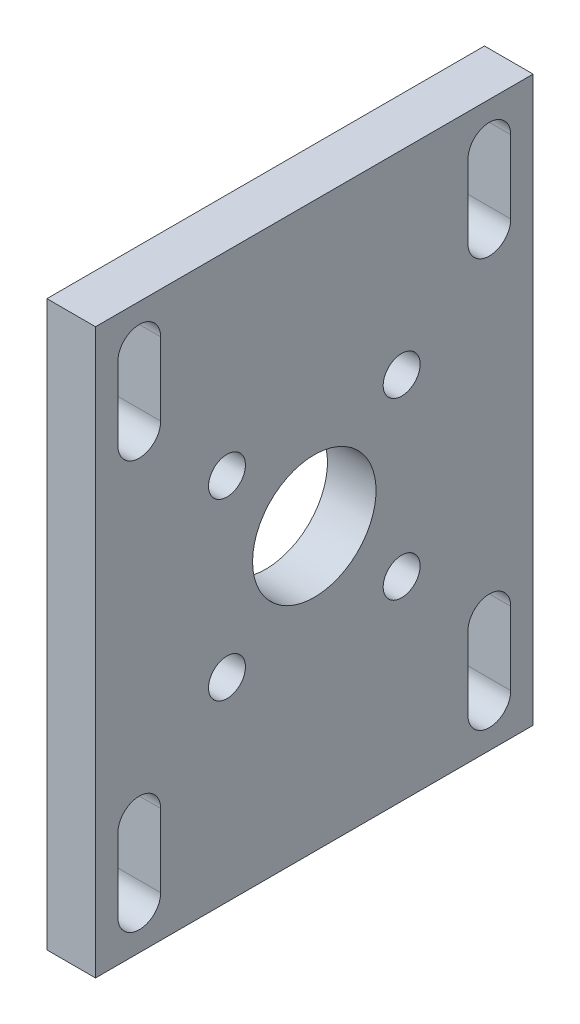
ISO-10303-21;
HEADER;
FILE_DESCRIPTION(('STEP AP214'),'2;1');
FILE_NAME('part.step','',(''),(''),'','','');
FILE_SCHEMA(('AUTOMOTIVE_DESIGN { 1 0 10303 214 1 1 1 1 }'));
ENDSEC;
DATA;
#1=APPLICATION_CONTEXT('core data for automotive mechanical design processes');
#2=APPLICATION_PROTOCOL_DEFINITION('international standard','automotive_design',2000,#1);
#3=PRODUCT_CONTEXT('',#1,'mechanical');
#4=PRODUCT('Part','Part','',(#3));
#5=PRODUCT_RELATED_PRODUCT_CATEGORY('part','',(#4));
#6=PRODUCT_DEFINITION_FORMATION('','',#4);
#7=PRODUCT_DEFINITION_CONTEXT('part definition',#1,'design');
#8=PRODUCT_DEFINITION('design','',#6,#7);
#9=PRODUCT_DEFINITION_SHAPE('','',#8);
#10=(LENGTH_UNIT() NAMED_UNIT(*) SI_UNIT(.MILLI.,.METRE.));
#11=(NAMED_UNIT(*) PLANE_ANGLE_UNIT() SI_UNIT($,.RADIAN.));
#12=(NAMED_UNIT(*) SI_UNIT($,.STERADIAN.) SOLID_ANGLE_UNIT());
#13=UNCERTAINTY_MEASURE_WITH_UNIT(LENGTH_MEASURE(1.E-05),#10,'distance_accuracy_value','');
#14=(GEOMETRIC_REPRESENTATION_CONTEXT(3) GLOBAL_UNCERTAINTY_ASSIGNED_CONTEXT((#13)) GLOBAL_UNIT_ASSIGNED_CONTEXT((#10,
#11,#12)) REPRESENTATION_CONTEXT('',''));
#15=CARTESIAN_POINT('',(0.,0.,0.));
#16=DIRECTION('',(0.,0.,1.));
#17=DIRECTION('',(1.,0.,0.));
#18=AXIS2_PLACEMENT_3D('',#15,#16,#17);
#19=CARTESIAN_POINT('',(5.,-29.,-22.5));
#20=DIRECTION('',(0.,0.,1.));
#21=DIRECTION('',(1.,0.,0.));
#22=AXIS2_PLACEMENT_3D('',#19,#20,#21);
#23=PLANE('',#22);
#24=DIRECTION('',(0.,1.,0.));
#25=VECTOR('',#24,1.);
#26=CARTESIAN_POINT('',(0.,-29.,-22.5));
#27=LINE('',#26,#25);
#28=CARTESIAN_POINT('',(0.,-29.,-22.5));
#29=VERTEX_POINT('',#28);
#30=CARTESIAN_POINT('',(0.,29.,-22.5));
#31=VERTEX_POINT('',#30);
#32=EDGE_CURVE('E285',#29,#31,#27,.T.);
#33=ORIENTED_EDGE('',*,*,#32,.T.);
#34=DIRECTION('',(-1.,0.,0.));
#35=VECTOR('',#34,1.);
#36=CARTESIAN_POINT('',(5.,29.,-22.5));
#37=LINE('',#36,#35);
#38=CARTESIAN_POINT('',(5.,29.,-22.5));
#39=VERTEX_POINT('',#38);
#40=EDGE_CURVE('E314',#39,#31,#37,.T.);
#41=ORIENTED_EDGE('',*,*,#40,.F.);
#42=DIRECTION('',(0.,1.,0.));
#43=VECTOR('',#42,1.);
#44=CARTESIAN_POINT('',(5.,-29.,-22.5));
#45=LINE('',#44,#43);
#46=CARTESIAN_POINT('',(5.,-29.,-22.5));
#47=VERTEX_POINT('',#46);
#48=EDGE_CURVE('E288',#47,#39,#45,.T.);
#49=ORIENTED_EDGE('',*,*,#48,.F.);
#50=DIRECTION('',(-1.,0.,0.));
#51=VECTOR('',#50,1.);
#52=CARTESIAN_POINT('',(5.,-29.,-22.5));
#53=LINE('',#52,#51);
#54=EDGE_CURVE('E298',#47,#29,#53,.T.);
#55=ORIENTED_EDGE('',*,*,#54,.T.);
#56=EDGE_LOOP('',(#33,#41,#49,#55));
#57=FACE_BOUND('',#56,.T.);
#58=ADVANCED_FACE('F33',(#57),#23,.F.);
#59=CARTESIAN_POINT('',(5.,29.,22.5));
#60=DIRECTION('',(0.,-1.,0.));
#61=DIRECTION('',(0.,0.,-1.));
#62=AXIS2_PLACEMENT_3D('',#59,#60,#61);
#63=PLANE('',#62);
#64=DIRECTION('',(0.,0.,1.));
#65=VECTOR('',#64,1.);
#66=CARTESIAN_POINT('',(0.,29.,22.5));
#67=LINE('',#66,#65);
#68=CARTESIAN_POINT('',(0.,29.,22.5));
#69=VERTEX_POINT('',#68);
#70=EDGE_CURVE('E301',#31,#69,#67,.T.);
#71=ORIENTED_EDGE('',*,*,#70,.T.);
#72=DIRECTION('',(-1.,0.,0.));
#73=VECTOR('',#72,1.);
#74=CARTESIAN_POINT('',(5.,29.,22.5));
#75=LINE('',#74,#73);
#76=CARTESIAN_POINT('',(5.,29.,22.5));
#77=VERTEX_POINT('',#76);
#78=EDGE_CURVE('E311',#77,#69,#75,.T.);
#79=ORIENTED_EDGE('',*,*,#78,.F.);
#80=DIRECTION('',(0.,0.,1.));
#81=VECTOR('',#80,1.);
#82=CARTESIAN_POINT('',(5.,29.,22.5));
#83=LINE('',#82,#81);
#84=EDGE_CURVE('E291',#39,#77,#83,.T.);
#85=ORIENTED_EDGE('',*,*,#84,.F.);
#86=ORIENTED_EDGE('',*,*,#40,.T.);
#87=EDGE_LOOP('',(#71,#79,#85,#86));
#88=FACE_BOUND('',#87,.T.);
#89=ADVANCED_FACE('F391',(#88),#63,.F.);
#90=CARTESIAN_POINT('',(5.,-29.,22.5));
#91=DIRECTION('',(0.,0.,-1.));
#92=DIRECTION('',(-1.,0.,0.));
#93=AXIS2_PLACEMENT_3D('',#90,#91,#92);
#94=PLANE('',#93);
#95=DIRECTION('',(0.,-1.,0.));
#96=VECTOR('',#95,1.);
#97=CARTESIAN_POINT('',(0.,-29.,22.5));
#98=LINE('',#97,#96);
#99=CARTESIAN_POINT('',(0.,-29.,22.5));
#100=VERTEX_POINT('',#99);
#101=EDGE_CURVE('E303',#69,#100,#98,.T.);
#102=ORIENTED_EDGE('',*,*,#101,.T.);
#103=DIRECTION('',(-1.,0.,0.));
#104=VECTOR('',#103,1.);
#105=CARTESIAN_POINT('',(5.,-29.,22.5));
#106=LINE('',#105,#104);
#107=CARTESIAN_POINT('',(5.,-29.,22.5));
#108=VERTEX_POINT('',#107);
#109=EDGE_CURVE('E308',#108,#100,#106,.T.);
#110=ORIENTED_EDGE('',*,*,#109,.F.);
#111=DIRECTION('',(0.,-1.,0.));
#112=VECTOR('',#111,1.);
#113=CARTESIAN_POINT('',(5.,-29.,22.5));
#114=LINE('',#113,#112);
#115=EDGE_CURVE('E294',#77,#108,#114,.T.);
#116=ORIENTED_EDGE('',*,*,#115,.F.);
#117=ORIENTED_EDGE('',*,*,#78,.T.);
#118=EDGE_LOOP('',(#102,#110,#116,#117));
#119=FACE_BOUND('',#118,.T.);
#120=ADVANCED_FACE('F397',(#119),#94,.F.);
#121=CARTESIAN_POINT('',(5.,-29.,22.5));
#122=DIRECTION('',(0.,1.,0.));
#123=DIRECTION('',(0.,0.,1.));
#124=AXIS2_PLACEMENT_3D('',#121,#122,#123);
#125=PLANE('',#124);
#126=DIRECTION('',(0.,0.,-1.));
#127=VECTOR('',#126,1.);
#128=CARTESIAN_POINT('',(0.,-29.,22.5));
#129=LINE('',#128,#127);
#130=EDGE_CURVE('E292',#100,#29,#129,.T.);
#131=ORIENTED_EDGE('',*,*,#130,.T.);
#132=ORIENTED_EDGE('',*,*,#54,.F.);
#133=DIRECTION('',(0.,0.,-1.));
#134=VECTOR('',#133,1.);
#135=CARTESIAN_POINT('',(5.,-29.,22.5));
#136=LINE('',#135,#134);
#137=EDGE_CURVE('E296',#108,#47,#136,.T.);
#138=ORIENTED_EDGE('',*,*,#137,.F.);
#139=ORIENTED_EDGE('',*,*,#109,.T.);
#140=EDGE_LOOP('',(#131,#132,#138,#139));
#141=FACE_BOUND('',#140,.T.);
#142=ADVANCED_FACE('F441',(#141),#125,.F.);
#143=CARTESIAN_POINT('',(5.,0.,0.));
#144=DIRECTION('',(-1.,0.,0.));
#145=DIRECTION('',(0.,0.,1.));
#146=AXIS2_PLACEMENT_3D('',#143,#144,#145);
#147=PLANE('',#146);
#148=DIRECTION('',(0.,-1.,0.));
#149=VECTOR('',#148,1.);
#150=CARTESIAN_POINT('',(5.,-24.75,15.8));
#151=LINE('',#150,#149);
#152=CARTESIAN_POINT('',(5.,-17.25,15.8));
#153=VERTEX_POINT('',#152);
#154=CARTESIAN_POINT('',(5.,-24.75,15.8));
#155=VERTEX_POINT('',#154);
#156=EDGE_CURVE('E205',#153,#155,#151,.T.);
#157=ORIENTED_EDGE('',*,*,#156,.T.);
#158=CARTESIAN_POINT('',(5.,-24.75,18.));
#159=DIRECTION('',(-1.,0.,0.));
#160=DIRECTION('',(0.,0.,1.));
#161=AXIS2_PLACEMENT_3D('',#158,#159,#160);
#162=CIRCLE('',#161,2.2);
#163=CARTESIAN_POINT('',(5.,-24.75,20.2));
#164=VERTEX_POINT('',#163);
#165=EDGE_CURVE('E210',#155,#164,#162,.T.);
#166=ORIENTED_EDGE('',*,*,#165,.T.);
#167=DIRECTION('',(0.,1.,0.));
#168=VECTOR('',#167,1.);
#169=CARTESIAN_POINT('',(5.,-24.75,20.2));
#170=LINE('',#169,#168);
#171=CARTESIAN_POINT('',(5.,-17.25,20.2));
#172=VERTEX_POINT('',#171);
#173=EDGE_CURVE('E182',#164,#172,#170,.T.);
#174=ORIENTED_EDGE('',*,*,#173,.T.);
#175=CARTESIAN_POINT('',(5.,-17.25,18.));
#176=DIRECTION('',(-1.,0.,0.));
#177=DIRECTION('',(0.,0.,1.));
#178=AXIS2_PLACEMENT_3D('',#175,#176,#177);
#179=CIRCLE('',#178,2.2);
#180=EDGE_CURVE('E189',#172,#153,#179,.T.);
#181=ORIENTED_EDGE('',*,*,#180,.T.);
#182=EDGE_LOOP('',(#157,#166,#174,#181));
#183=FACE_BOUND('',#182,.T.);
#184=DIRECTION('',(0.,-1.,0.));
#185=VECTOR('',#184,1.);
#186=CARTESIAN_POINT('',(5.,-24.75,-20.2));
#187=LINE('',#186,#185);
#188=CARTESIAN_POINT('',(5.,-17.25,-20.2));
#189=VERTEX_POINT('',#188);
#190=CARTESIAN_POINT('',(5.,-24.75,-20.2));
#191=VERTEX_POINT('',#190);
#192=EDGE_CURVE('E224',#189,#191,#187,.T.);
#193=ORIENTED_EDGE('',*,*,#192,.T.);
#194=CARTESIAN_POINT('',(5.,-24.75,-18.));
#195=DIRECTION('',(-1.,0.,0.));
#196=DIRECTION('',(0.,0.,1.));
#197=AXIS2_PLACEMENT_3D('',#194,#195,#196);
#198=CIRCLE('',#197,2.2);
#199=CARTESIAN_POINT('',(5.,-24.75,-15.8));
#200=VERTEX_POINT('',#199);
#201=EDGE_CURVE('E214',#191,#200,#198,.T.);
#202=ORIENTED_EDGE('',*,*,#201,.T.);
#203=DIRECTION('',(0.,1.,0.));
#204=VECTOR('',#203,1.);
#205=CARTESIAN_POINT('',(5.,-24.75,-15.8));
#206=LINE('',#205,#204);
#207=CARTESIAN_POINT('',(5.,-17.25,-15.8));
#208=VERTEX_POINT('',#207);
#209=EDGE_CURVE('E217',#200,#208,#206,.T.);
#210=ORIENTED_EDGE('',*,*,#209,.T.);
#211=CARTESIAN_POINT('',(5.,-17.25,-18.));
#212=DIRECTION('',(-1.,0.,0.));
#213=DIRECTION('',(0.,0.,1.));
#214=AXIS2_PLACEMENT_3D('',#211,#212,#213);
#215=CIRCLE('',#214,2.2);
#216=EDGE_CURVE('E221',#208,#189,#215,.T.);
#217=ORIENTED_EDGE('',*,*,#216,.T.);
#218=EDGE_LOOP('',(#193,#202,#210,#217));
#219=FACE_BOUND('',#218,.T.);
#220=CARTESIAN_POINT('',(5.,8.98025612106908,-8.98025612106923));
#221=DIRECTION('',(-1.,0.,0.));
#222=DIRECTION('',(0.,0.,1.));
#223=AXIS2_PLACEMENT_3D('',#220,#221,#222);
#224=CIRCLE('',#223,1.89865);
#225=CARTESIAN_POINT('',(5.,8.98025612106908,-7.08160612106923));
#226=VERTEX_POINT('',#225);
#227=EDGE_CURVE('E251',#226,#226,#224,.T.);
#228=ORIENTED_EDGE('',*,*,#227,.T.);
#229=EDGE_LOOP('',(#228));
#230=FACE_BOUND('',#229,.T.);
#231=CARTESIAN_POINT('',(5.,8.98025612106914,8.98025612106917));
#232=DIRECTION('',(-1.,0.,0.));
#233=DIRECTION('',(0.,0.,1.));
#234=AXIS2_PLACEMENT_3D('',#231,#232,#233);
#235=CIRCLE('',#234,1.89865);
#236=CARTESIAN_POINT('',(5.,8.98025612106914,10.8789061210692));
#237=VERTEX_POINT('',#236);
#238=EDGE_CURVE('E260',#237,#237,#235,.T.);
#239=ORIENTED_EDGE('',*,*,#238,.T.);
#240=EDGE_LOOP('',(#239));
#241=FACE_BOUND('',#240,.T.);
#242=CARTESIAN_POINT('',(5.,-8.98025612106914,8.98025612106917));
#243=DIRECTION('',(-1.,0.,0.));
#244=DIRECTION('',(0.,0.,1.));
#245=AXIS2_PLACEMENT_3D('',#242,#243,#244);
#246=CIRCLE('',#245,1.89865);
#247=CARTESIAN_POINT('',(5.,-8.98025612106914,10.8789061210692));
#248=VERTEX_POINT('',#247);
#249=EDGE_CURVE('E269',#248,#248,#246,.T.);
#250=ORIENTED_EDGE('',*,*,#249,.T.);
#251=EDGE_LOOP('',(#250));
#252=FACE_BOUND('',#251,.T.);
#253=CARTESIAN_POINT('',(5.,-8.98025612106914,-8.98025612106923));
#254=DIRECTION('',(-1.,0.,0.));
#255=DIRECTION('',(0.,0.,1.));
#256=AXIS2_PLACEMENT_3D('',#253,#254,#255);
#257=CIRCLE('',#256,1.89865);
#258=CARTESIAN_POINT('',(5.,-8.98025612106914,-7.08160612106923));
#259=VERTEX_POINT('',#258);
#260=EDGE_CURVE('E278',#259,#259,#257,.T.);
#261=ORIENTED_EDGE('',*,*,#260,.T.);
#262=EDGE_LOOP('',(#261));
#263=FACE_BOUND('',#262,.T.);
#264=CARTESIAN_POINT('',(5.,0.,0.));
#265=DIRECTION('',(-1.,0.,0.));
#266=DIRECTION('',(0.,0.,1.));
#267=AXIS2_PLACEMENT_3D('',#264,#265,#266);
#268=CIRCLE('',#267,6.35);
#269=CARTESIAN_POINT('',(5.,0.,6.35));
#270=VERTEX_POINT('',#269);
#271=EDGE_CURVE('E282',#270,#270,#268,.T.);
#272=ORIENTED_EDGE('',*,*,#271,.T.);
#273=EDGE_LOOP('',(#272));
#274=FACE_BOUND('',#273,.T.);
#275=ORIENTED_EDGE('',*,*,#48,.T.);
#276=ORIENTED_EDGE('',*,*,#84,.T.);
#277=ORIENTED_EDGE('',*,*,#115,.T.);
#278=ORIENTED_EDGE('',*,*,#137,.T.);
#279=EDGE_LOOP('',(#275,#276,#277,#278));
#280=FACE_BOUND('',#279,.T.);
#281=CARTESIAN_POINT('',(5.,17.25,-18.));
#282=DIRECTION('',(-1.,0.,0.));
#283=DIRECTION('',(0.,0.,1.));
#284=AXIS2_PLACEMENT_3D('',#281,#282,#283);
#285=CIRCLE('',#284,2.2);
#286=CARTESIAN_POINT('',(5.,17.25,-20.2));
#287=VERTEX_POINT('',#286);
#288=CARTESIAN_POINT('',(5.,17.25,-15.8));
#289=VERTEX_POINT('',#288);
#290=EDGE_CURVE('E328',#287,#289,#285,.T.);
#291=ORIENTED_EDGE('',*,*,#290,.T.);
#292=DIRECTION('',(0.,1.,0.));
#293=VECTOR('',#292,1.);
#294=CARTESIAN_POINT('',(5.,17.25,-15.8));
#295=LINE('',#294,#293);
#296=CARTESIAN_POINT('',(5.,24.75,-15.8));
#297=VERTEX_POINT('',#296);
#298=EDGE_CURVE('E330',#289,#297,#295,.T.);
#299=ORIENTED_EDGE('',*,*,#298,.T.);
#300=CARTESIAN_POINT('',(5.,24.75,-18.));
#301=DIRECTION('',(-1.,0.,0.));
#302=DIRECTION('',(0.,0.,1.));
#303=AXIS2_PLACEMENT_3D('',#300,#301,#302);
#304=CIRCLE('',#303,2.2);
#305=CARTESIAN_POINT('',(5.,24.75,-20.2));
#306=VERTEX_POINT('',#305);
#307=EDGE_CURVE('E332',#297,#306,#304,.T.);
#308=ORIENTED_EDGE('',*,*,#307,.T.);
#309=DIRECTION('',(0.,-1.,0.));
#310=VECTOR('',#309,1.);
#311=CARTESIAN_POINT('',(5.,17.25,-20.2));
#312=LINE('',#311,#310);
#313=EDGE_CURVE('E334',#306,#287,#312,.T.);
#314=ORIENTED_EDGE('',*,*,#313,.T.);
#315=EDGE_LOOP('',(#291,#299,#308,#314));
#316=FACE_BOUND('',#315,.T.);
#317=CARTESIAN_POINT('',(5.,17.25,18.));
#318=DIRECTION('',(-1.,0.,0.));
#319=DIRECTION('',(0.,0.,1.));
#320=AXIS2_PLACEMENT_3D('',#317,#318,#319);
#321=CIRCLE('',#320,2.2);
#322=CARTESIAN_POINT('',(5.,17.25,15.8));
#323=VERTEX_POINT('',#322);
#324=CARTESIAN_POINT('',(5.,17.25,20.2));
#325=VERTEX_POINT('',#324);
#326=EDGE_CURVE('E48',#323,#325,#321,.T.);
#327=ORIENTED_EDGE('',*,*,#326,.T.);
#328=DIRECTION('',(0.,1.,0.));
#329=VECTOR('',#328,1.);
#330=CARTESIAN_POINT('',(5.,17.25,20.2));
#331=LINE('',#330,#329);
#332=CARTESIAN_POINT('',(5.,24.75,20.2));
#333=VERTEX_POINT('',#332);
#334=EDGE_CURVE('E361',#325,#333,#331,.T.);
#335=ORIENTED_EDGE('',*,*,#334,.T.);
#336=CARTESIAN_POINT('',(5.,24.75,18.));
#337=DIRECTION('',(-1.,0.,0.));
#338=DIRECTION('',(0.,0.,1.));
#339=AXIS2_PLACEMENT_3D('',#336,#337,#338);
#340=CIRCLE('',#339,2.2);
#341=CARTESIAN_POINT('',(5.,24.75,15.8));
#342=VERTEX_POINT('',#341);
#343=EDGE_CURVE('E55',#333,#342,#340,.T.);
#344=ORIENTED_EDGE('',*,*,#343,.T.);
#345=DIRECTION('',(0.,-1.,0.));
#346=VECTOR('',#345,1.);
#347=CARTESIAN_POINT('',(5.,17.25,15.8));
#348=LINE('',#347,#346);
#349=EDGE_CURVE('E364',#342,#323,#348,.T.);
#350=ORIENTED_EDGE('',*,*,#349,.T.);
#351=EDGE_LOOP('',(#327,#335,#344,#350));
#352=FACE_BOUND('',#351,.T.);
#353=ADVANCED_FACE('F429',(#183,#219,#230,#241,#252,#263,#274,#280,#316,#352),#147,.F.);
#354=CARTESIAN_POINT('',(0.,0.,0.));
#355=DIRECTION('',(-1.,0.,0.));
#356=DIRECTION('',(0.,0.,1.));
#357=AXIS2_PLACEMENT_3D('',#354,#355,#356);
#358=PLANE('',#357);
#359=CARTESIAN_POINT('',(0.,-24.75,18.));
#360=DIRECTION('',(-1.,0.,0.));
#361=DIRECTION('',(0.,0.,1.));
#362=AXIS2_PLACEMENT_3D('',#359,#360,#361);
#363=CIRCLE('',#362,2.2);
#364=CARTESIAN_POINT('',(0.,-24.75,15.8));
#365=VERTEX_POINT('',#364);
#366=CARTESIAN_POINT('',(0.,-24.75,20.2));
#367=VERTEX_POINT('',#366);
#368=EDGE_CURVE('E208',#365,#367,#363,.T.);
#369=ORIENTED_EDGE('',*,*,#368,.F.);
#370=DIRECTION('',(0.,-1.,0.));
#371=VECTOR('',#370,1.);
#372=CARTESIAN_POINT('',(0.,-24.75,15.8));
#373=LINE('',#372,#371);
#374=CARTESIAN_POINT('',(0.,-17.25,15.8));
#375=VERTEX_POINT('',#374);
#376=EDGE_CURVE('E194',#375,#365,#373,.T.);
#377=ORIENTED_EDGE('',*,*,#376,.F.);
#378=CARTESIAN_POINT('',(0.,-17.25,18.));
#379=DIRECTION('',(-1.,0.,0.));
#380=DIRECTION('',(0.,0.,1.));
#381=AXIS2_PLACEMENT_3D('',#378,#379,#380);
#382=CIRCLE('',#381,2.2);
#383=CARTESIAN_POINT('',(0.,-17.25,20.2));
#384=VERTEX_POINT('',#383);
#385=EDGE_CURVE('E186',#384,#375,#382,.T.);
#386=ORIENTED_EDGE('',*,*,#385,.F.);
#387=DIRECTION('',(0.,1.,0.));
#388=VECTOR('',#387,1.);
#389=CARTESIAN_POINT('',(0.,-24.75,20.2));
#390=LINE('',#389,#388);
#391=EDGE_CURVE('E172',#367,#384,#390,.T.);
#392=ORIENTED_EDGE('',*,*,#391,.F.);
#393=EDGE_LOOP('',(#369,#377,#386,#392));
#394=FACE_BOUND('',#393,.T.);
#395=CARTESIAN_POINT('',(0.,-24.75,-18.));
#396=DIRECTION('',(-1.,0.,0.));
#397=DIRECTION('',(0.,0.,1.));
#398=AXIS2_PLACEMENT_3D('',#395,#396,#397);
#399=CIRCLE('',#398,2.2);
#400=CARTESIAN_POINT('',(0.,-24.75,-20.2));
#401=VERTEX_POINT('',#400);
#402=CARTESIAN_POINT('',(0.,-24.75,-15.8));
#403=VERTEX_POINT('',#402);
#404=EDGE_CURVE('E213',#401,#403,#399,.T.);
#405=ORIENTED_EDGE('',*,*,#404,.F.);
#406=DIRECTION('',(0.,-1.,0.));
#407=VECTOR('',#406,1.);
#408=CARTESIAN_POINT('',(0.,-24.75,-20.2));
#409=LINE('',#408,#407);
#410=CARTESIAN_POINT('',(0.,-17.25,-20.2));
#411=VERTEX_POINT('',#410);
#412=EDGE_CURVE('E218',#411,#401,#409,.T.);
#413=ORIENTED_EDGE('',*,*,#412,.F.);
#414=CARTESIAN_POINT('',(0.,-17.25,-18.));
#415=DIRECTION('',(-1.,0.,0.));
#416=DIRECTION('',(0.,0.,1.));
#417=AXIS2_PLACEMENT_3D('',#414,#415,#416);
#418=CIRCLE('',#417,2.2);
#419=CARTESIAN_POINT('',(0.,-17.25,-15.8));
#420=VERTEX_POINT('',#419);
#421=EDGE_CURVE('E232',#420,#411,#418,.T.);
#422=ORIENTED_EDGE('',*,*,#421,.F.);
#423=DIRECTION('',(0.,1.,0.));
#424=VECTOR('',#423,1.);
#425=CARTESIAN_POINT('',(0.,-24.75,-15.8));
#426=LINE('',#425,#424);
#427=EDGE_CURVE('E229',#403,#420,#426,.T.);
#428=ORIENTED_EDGE('',*,*,#427,.F.);
#429=EDGE_LOOP('',(#405,#413,#422,#428));
#430=FACE_BOUND('',#429,.T.);
#431=CARTESIAN_POINT('',(0.,8.98025612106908,-8.98025612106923));
#432=DIRECTION('',(-1.,0.,0.));
#433=DIRECTION('',(0.,0.,1.));
#434=AXIS2_PLACEMENT_3D('',#431,#432,#433);
#435=CIRCLE('',#434,3.8989);
#436=CARTESIAN_POINT('',(0.,8.98025612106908,-5.08135612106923));
#437=VERTEX_POINT('',#436);
#438=EDGE_CURVE('E239',#437,#437,#435,.T.);
#439=ORIENTED_EDGE('',*,*,#438,.F.);
#440=EDGE_LOOP('',(#439));
#441=FACE_BOUND('',#440,.T.);
#442=CARTESIAN_POINT('',(0.,8.98025612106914,8.98025612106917));
#443=DIRECTION('',(-1.,0.,0.));
#444=DIRECTION('',(0.,0.,1.));
#445=AXIS2_PLACEMENT_3D('',#442,#443,#444);
#446=CIRCLE('',#445,3.8989);
#447=CARTESIAN_POINT('',(0.,8.98025612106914,12.8791561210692));
#448=VERTEX_POINT('',#447);
#449=EDGE_CURVE('E254',#448,#448,#446,.T.);
#450=ORIENTED_EDGE('',*,*,#449,.F.);
#451=EDGE_LOOP('',(#450));
#452=FACE_BOUND('',#451,.T.);
#453=CARTESIAN_POINT('',(0.,-8.98025612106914,8.98025612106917));
#454=DIRECTION('',(-1.,0.,0.));
#455=DIRECTION('',(0.,0.,1.));
#456=AXIS2_PLACEMENT_3D('',#453,#454,#455);
#457=CIRCLE('',#456,3.8989);
#458=CARTESIAN_POINT('',(0.,-8.98025612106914,12.8791561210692));
#459=VERTEX_POINT('',#458);
#460=EDGE_CURVE('E263',#459,#459,#457,.T.);
#461=ORIENTED_EDGE('',*,*,#460,.F.);
#462=EDGE_LOOP('',(#461));
#463=FACE_BOUND('',#462,.T.);
#464=CARTESIAN_POINT('',(0.,-8.98025612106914,-8.98025612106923));
#465=DIRECTION('',(-1.,0.,0.));
#466=DIRECTION('',(0.,0.,1.));
#467=AXIS2_PLACEMENT_3D('',#464,#465,#466);
#468=CIRCLE('',#467,3.8989);
#469=CARTESIAN_POINT('',(0.,-8.98025612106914,-5.08135612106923));
#470=VERTEX_POINT('',#469);
#471=EDGE_CURVE('E272',#470,#470,#468,.T.);
#472=ORIENTED_EDGE('',*,*,#471,.F.);
#473=EDGE_LOOP('',(#472));
#474=FACE_BOUND('',#473,.T.);
#475=CARTESIAN_POINT('',(0.,0.,0.));
#476=DIRECTION('',(-1.,0.,0.));
#477=DIRECTION('',(0.,0.,1.));
#478=AXIS2_PLACEMENT_3D('',#475,#476,#477);
#479=CIRCLE('',#478,6.35);
#480=CARTESIAN_POINT('',(0.,0.,6.35));
#481=VERTEX_POINT('',#480);
#482=EDGE_CURVE('E281',#481,#481,#479,.T.);
#483=ORIENTED_EDGE('',*,*,#482,.F.);
#484=EDGE_LOOP('',(#483));
#485=FACE_BOUND('',#484,.T.);
#486=ORIENTED_EDGE('',*,*,#32,.F.);
#487=ORIENTED_EDGE('',*,*,#130,.F.);
#488=ORIENTED_EDGE('',*,*,#101,.F.);
#489=ORIENTED_EDGE('',*,*,#70,.F.);
#490=EDGE_LOOP('',(#486,#487,#488,#489));
#491=FACE_BOUND('',#490,.T.);
#492=CARTESIAN_POINT('',(0.,17.25,-18.));
#493=DIRECTION('',(-1.,0.,0.));
#494=DIRECTION('',(0.,0.,1.));
#495=AXIS2_PLACEMENT_3D('',#492,#493,#494);
#496=CIRCLE('',#495,2.2);
#497=CARTESIAN_POINT('',(0.,17.25,-20.2));
#498=VERTEX_POINT('',#497);
#499=CARTESIAN_POINT('',(0.,17.25,-15.8));
#500=VERTEX_POINT('',#499);
#501=EDGE_CURVE('E317',#498,#500,#496,.T.);
#502=ORIENTED_EDGE('',*,*,#501,.F.);
#503=DIRECTION('',(0.,-1.,0.));
#504=VECTOR('',#503,1.);
#505=CARTESIAN_POINT('',(0.,17.25,-20.2));
#506=LINE('',#505,#504);
#507=CARTESIAN_POINT('',(0.,24.75,-20.2));
#508=VERTEX_POINT('',#507);
#509=EDGE_CURVE('E319',#508,#498,#506,.T.);
#510=ORIENTED_EDGE('',*,*,#509,.F.);
#511=CARTESIAN_POINT('',(0.,24.75,-18.));
#512=DIRECTION('',(-1.,0.,0.));
#513=DIRECTION('',(0.,0.,1.));
#514=AXIS2_PLACEMENT_3D('',#511,#512,#513);
#515=CIRCLE('',#514,2.2);
#516=CARTESIAN_POINT('',(0.,24.75,-15.8));
#517=VERTEX_POINT('',#516);
#518=EDGE_CURVE('E322',#517,#508,#515,.T.);
#519=ORIENTED_EDGE('',*,*,#518,.F.);
#520=DIRECTION('',(0.,1.,0.));
#521=VECTOR('',#520,1.);
#522=CARTESIAN_POINT('',(0.,17.25,-15.8));
#523=LINE('',#522,#521);
#524=EDGE_CURVE('E325',#500,#517,#523,.T.);
#525=ORIENTED_EDGE('',*,*,#524,.F.);
#526=EDGE_LOOP('',(#502,#510,#519,#525));
#527=FACE_BOUND('',#526,.T.);
#528=CARTESIAN_POINT('',(0.,17.25,18.));
#529=DIRECTION('',(-1.,0.,0.));
#530=DIRECTION('',(0.,0.,1.));
#531=AXIS2_PLACEMENT_3D('',#528,#529,#530);
#532=CIRCLE('',#531,2.2);
#533=CARTESIAN_POINT('',(0.,17.25,15.8));
#534=VERTEX_POINT('',#533);
#535=CARTESIAN_POINT('',(0.,17.25,20.2));
#536=VERTEX_POINT('',#535);
#537=EDGE_CURVE('E349',#534,#536,#532,.T.);
#538=ORIENTED_EDGE('',*,*,#537,.F.);
#539=DIRECTION('',(0.,-1.,0.));
#540=VECTOR('',#539,1.);
#541=CARTESIAN_POINT('',(0.,17.25,15.8));
#542=LINE('',#541,#540);
#543=CARTESIAN_POINT('',(0.,24.75,15.8));
#544=VERTEX_POINT('',#543);
#545=EDGE_CURVE('E351',#544,#534,#542,.T.);
#546=ORIENTED_EDGE('',*,*,#545,.F.);
#547=CARTESIAN_POINT('',(0.,24.75,18.));
#548=DIRECTION('',(-1.,0.,0.));
#549=DIRECTION('',(0.,0.,1.));
#550=AXIS2_PLACEMENT_3D('',#547,#548,#549);
#551=CIRCLE('',#550,2.2);
#552=CARTESIAN_POINT('',(0.,24.75,20.2));
#553=VERTEX_POINT('',#552);
#554=EDGE_CURVE('E354',#553,#544,#551,.T.);
#555=ORIENTED_EDGE('',*,*,#554,.F.);
#556=DIRECTION('',(0.,1.,0.));
#557=VECTOR('',#556,1.);
#558=CARTESIAN_POINT('',(0.,17.25,20.2));
#559=LINE('',#558,#557);
#560=EDGE_CURVE('E357',#536,#553,#559,.T.);
#561=ORIENTED_EDGE('',*,*,#560,.F.);
#562=EDGE_LOOP('',(#538,#546,#555,#561));
#563=FACE_BOUND('',#562,.T.);
#564=ADVANCED_FACE('F192',(#394,#430,#441,#452,#463,#474,#485,#491,#527,#563),#358,.T.);
#565=CARTESIAN_POINT('',(5.,0.,0.));
#566=DIRECTION('',(-1.,0.,0.));
#567=DIRECTION('',(0.,0.,1.));
#568=AXIS2_PLACEMENT_3D('',#565,#566,#567);
#569=CYLINDRICAL_SURFACE('',#568,6.35);
#570=ORIENTED_EDGE('',*,*,#271,.F.);
#571=EDGE_LOOP('',(#570));
#572=FACE_BOUND('',#571,.T.);
#573=ORIENTED_EDGE('',*,*,#482,.T.);
#574=EDGE_LOOP('',(#573));
#575=FACE_BOUND('',#574,.T.);
#576=ADVANCED_FACE('F432',(#572,#575),#569,.F.);
#577=CARTESIAN_POINT('',(0.,-8.98025612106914,-8.98025612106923));
#578=DIRECTION('',(-1.,0.,0.));
#579=DIRECTION('',(0.,0.,1.));
#580=AXIS2_PLACEMENT_3D('',#577,#578,#579);
#581=CYLINDRICAL_SURFACE('',#580,1.89865);
#582=ORIENTED_EDGE('',*,*,#260,.F.);
#583=EDGE_LOOP('',(#582));
#584=FACE_BOUND('',#583,.T.);
#585=CARTESIAN_POINT('',(2.30102440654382,-8.98025612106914,-8.98025612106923));
#586=DIRECTION('',(-1.,0.,0.));
#587=DIRECTION('',(0.,0.,1.));
#588=AXIS2_PLACEMENT_3D('',#585,#586,#587);
#589=CIRCLE('',#588,1.89865);
#590=CARTESIAN_POINT('',(2.30102440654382,-8.98025612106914,-7.08160612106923));
#591=VERTEX_POINT('',#590);
#592=EDGE_CURVE('E275',#591,#591,#589,.T.);
#593=ORIENTED_EDGE('',*,*,#592,.T.);
#594=EDGE_LOOP('',(#593));
#595=FACE_BOUND('',#594,.T.);
#596=ADVANCED_FACE('F438',(#584,#595),#581,.F.);
#597=CARTESIAN_POINT('',(0.,-8.98025612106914,-8.98025612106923));
#598=DIRECTION('',(-1.,0.,0.));
#599=DIRECTION('',(0.,0.,1.));
#600=AXIS2_PLACEMENT_3D('',#597,#598,#599);
#601=CONICAL_SURFACE('',#600,3.8989,0.715584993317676);
#602=ORIENTED_EDGE('',*,*,#592,.F.);
#603=EDGE_LOOP('',(#602));
#604=FACE_BOUND('',#603,.T.);
#605=ORIENTED_EDGE('',*,*,#471,.T.);
#606=EDGE_LOOP('',(#605));
#607=FACE_BOUND('',#606,.T.);
#608=ADVANCED_FACE('F607',(#604,#607),#601,.F.);
#609=CARTESIAN_POINT('',(0.,-8.98025612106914,8.98025612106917));
#610=DIRECTION('',(-1.,0.,0.));
#611=DIRECTION('',(0.,0.,1.));
#612=AXIS2_PLACEMENT_3D('',#609,#610,#611);
#613=CYLINDRICAL_SURFACE('',#612,1.89865);
#614=ORIENTED_EDGE('',*,*,#249,.F.);
#615=EDGE_LOOP('',(#614));
#616=FACE_BOUND('',#615,.T.);
#617=CARTESIAN_POINT('',(2.30102440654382,-8.98025612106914,8.98025612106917));
#618=DIRECTION('',(-1.,0.,0.));
#619=DIRECTION('',(0.,0.,1.));
#620=AXIS2_PLACEMENT_3D('',#617,#618,#619);
#621=CIRCLE('',#620,1.89865);
#622=CARTESIAN_POINT('',(2.30102440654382,-8.98025612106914,10.8789061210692));
#623=VERTEX_POINT('',#622);
#624=EDGE_CURVE('E266',#623,#623,#621,.T.);
#625=ORIENTED_EDGE('',*,*,#624,.T.);
#626=EDGE_LOOP('',(#625));
#627=FACE_BOUND('',#626,.T.);
#628=ADVANCED_FACE('F603',(#616,#627),#613,.F.);
#629=CARTESIAN_POINT('',(0.,-8.98025612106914,8.98025612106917));
#630=DIRECTION('',(-1.,0.,0.));
#631=DIRECTION('',(0.,0.,1.));
#632=AXIS2_PLACEMENT_3D('',#629,#630,#631);
#633=CONICAL_SURFACE('',#632,3.8989,0.715584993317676);
#634=ORIENTED_EDGE('',*,*,#624,.F.);
#635=EDGE_LOOP('',(#634));
#636=FACE_BOUND('',#635,.T.);
#637=ORIENTED_EDGE('',*,*,#460,.T.);
#638=EDGE_LOOP('',(#637));
#639=FACE_BOUND('',#638,.T.);
#640=ADVANCED_FACE('F599',(#636,#639),#633,.F.);
#641=CARTESIAN_POINT('',(0.,8.98025612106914,8.98025612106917));
#642=DIRECTION('',(-1.,0.,0.));
#643=DIRECTION('',(0.,0.,1.));
#644=AXIS2_PLACEMENT_3D('',#641,#642,#643);
#645=CYLINDRICAL_SURFACE('',#644,1.89865);
#646=ORIENTED_EDGE('',*,*,#238,.F.);
#647=EDGE_LOOP('',(#646));
#648=FACE_BOUND('',#647,.T.);
#649=CARTESIAN_POINT('',(2.30102440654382,8.98025612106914,8.98025612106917));
#650=DIRECTION('',(-1.,0.,0.));
#651=DIRECTION('',(0.,0.,1.));
#652=AXIS2_PLACEMENT_3D('',#649,#650,#651);
#653=CIRCLE('',#652,1.89865);
#654=CARTESIAN_POINT('',(2.30102440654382,8.98025612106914,10.8789061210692));
#655=VERTEX_POINT('',#654);
#656=EDGE_CURVE('E257',#655,#655,#653,.T.);
#657=ORIENTED_EDGE('',*,*,#656,.T.);
#658=EDGE_LOOP('',(#657));
#659=FACE_BOUND('',#658,.T.);
#660=ADVANCED_FACE('F595',(#648,#659),#645,.F.);
#661=CARTESIAN_POINT('',(0.,8.98025612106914,8.98025612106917));
#662=DIRECTION('',(-1.,0.,0.));
#663=DIRECTION('',(0.,0.,1.));
#664=AXIS2_PLACEMENT_3D('',#661,#662,#663);
#665=CONICAL_SURFACE('',#664,3.8989,0.715584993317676);
#666=ORIENTED_EDGE('',*,*,#656,.F.);
#667=EDGE_LOOP('',(#666));
#668=FACE_BOUND('',#667,.T.);
#669=ORIENTED_EDGE('',*,*,#449,.T.);
#670=EDGE_LOOP('',(#669));
#671=FACE_BOUND('',#670,.T.);
#672=ADVANCED_FACE('F591',(#668,#671),#665,.F.);
#673=CARTESIAN_POINT('',(0.,8.98025612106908,-8.98025612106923));
#674=DIRECTION('',(-1.,0.,0.));
#675=DIRECTION('',(0.,0.,1.));
#676=AXIS2_PLACEMENT_3D('',#673,#674,#675);
#677=CYLINDRICAL_SURFACE('',#676,1.89865);
#678=ORIENTED_EDGE('',*,*,#227,.F.);
#679=EDGE_LOOP('',(#678));
#680=FACE_BOUND('',#679,.T.);
#681=CARTESIAN_POINT('',(2.30102440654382,8.98025612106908,-8.98025612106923));
#682=DIRECTION('',(-1.,0.,0.));
#683=DIRECTION('',(0.,0.,1.));
#684=AXIS2_PLACEMENT_3D('',#681,#682,#683);
#685=CIRCLE('',#684,1.89865);
#686=CARTESIAN_POINT('',(2.30102440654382,8.98025612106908,-7.08160612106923));
#687=VERTEX_POINT('',#686);
#688=EDGE_CURVE('E248',#687,#687,#685,.T.);
#689=ORIENTED_EDGE('',*,*,#688,.T.);
#690=EDGE_LOOP('',(#689));
#691=FACE_BOUND('',#690,.T.);
#692=ADVANCED_FACE('F587',(#680,#691),#677,.F.);
#693=CARTESIAN_POINT('',(0.,8.98025612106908,-8.98025612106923));
#694=DIRECTION('',(-1.,0.,0.));
#695=DIRECTION('',(0.,0.,1.));
#696=AXIS2_PLACEMENT_3D('',#693,#694,#695);
#697=CONICAL_SURFACE('',#696,3.8989,0.715584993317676);
#698=ORIENTED_EDGE('',*,*,#688,.F.);
#699=EDGE_LOOP('',(#698));
#700=FACE_BOUND('',#699,.T.);
#701=ORIENTED_EDGE('',*,*,#438,.T.);
#702=EDGE_LOOP('',(#701));
#703=FACE_BOUND('',#702,.T.);
#704=ADVANCED_FACE('F583',(#700,#703),#697,.F.);
#705=CARTESIAN_POINT('',(5.,-24.75,-18.));
#706=DIRECTION('',(-1.,0.,0.));
#707=DIRECTION('',(0.,0.,1.));
#708=AXIS2_PLACEMENT_3D('',#705,#706,#707);
#709=CYLINDRICAL_SURFACE('',#708,2.2);
#710=ORIENTED_EDGE('',*,*,#404,.T.);
#711=DIRECTION('',(-1.,0.,0.));
#712=VECTOR('',#711,1.);
#713=CARTESIAN_POINT('',(5.,-24.75,-15.8));
#714=LINE('',#713,#712);
#715=EDGE_CURVE('E227',#200,#403,#714,.T.);
#716=ORIENTED_EDGE('',*,*,#715,.F.);
#717=ORIENTED_EDGE('',*,*,#201,.F.);
#718=DIRECTION('',(-1.,0.,0.));
#719=VECTOR('',#718,1.);
#720=CARTESIAN_POINT('',(5.,-24.75,-20.2));
#721=LINE('',#720,#719);
#722=EDGE_CURVE('E237',#191,#401,#721,.T.);
#723=ORIENTED_EDGE('',*,*,#722,.T.);
#724=EDGE_LOOP('',(#710,#716,#717,#723));
#725=FACE_BOUND('',#724,.T.);
#726=ADVANCED_FACE('F574',(#725),#709,.F.);
#727=CARTESIAN_POINT('',(5.,-24.75,-20.2));
#728=DIRECTION('',(0.,0.,-1.));
#729=DIRECTION('',(-1.,0.,0.));
#730=AXIS2_PLACEMENT_3D('',#727,#728,#729);
#731=PLANE('',#730);
#732=ORIENTED_EDGE('',*,*,#412,.T.);
#733=ORIENTED_EDGE('',*,*,#722,.F.);
#734=ORIENTED_EDGE('',*,*,#192,.F.);
#735=DIRECTION('',(-1.,0.,0.));
#736=VECTOR('',#735,1.);
#737=CARTESIAN_POINT('',(5.,-17.25,-20.2));
#738=LINE('',#737,#736);
#739=EDGE_CURVE('E240',#189,#411,#738,.T.);
#740=ORIENTED_EDGE('',*,*,#739,.T.);
#741=EDGE_LOOP('',(#732,#733,#734,#740));
#742=FACE_BOUND('',#741,.T.);
#743=ADVANCED_FACE('F570',(#742),#731,.F.);
#744=CARTESIAN_POINT('',(5.,-17.25,-18.));
#745=DIRECTION('',(-1.,0.,0.));
#746=DIRECTION('',(0.,0.,1.));
#747=AXIS2_PLACEMENT_3D('',#744,#745,#746);
#748=CYLINDRICAL_SURFACE('',#747,2.2);
#749=ORIENTED_EDGE('',*,*,#421,.T.);
#750=ORIENTED_EDGE('',*,*,#739,.F.);
#751=ORIENTED_EDGE('',*,*,#216,.F.);
#752=DIRECTION('',(-1.,0.,0.));
#753=VECTOR('',#752,1.);
#754=CARTESIAN_POINT('',(5.,-17.25,-15.8));
#755=LINE('',#754,#753);
#756=EDGE_CURVE('E242',#208,#420,#755,.T.);
#757=ORIENTED_EDGE('',*,*,#756,.T.);
#758=EDGE_LOOP('',(#749,#750,#751,#757));
#759=FACE_BOUND('',#758,.T.);
#760=ADVANCED_FACE('F573',(#759),#748,.F.);
#761=CARTESIAN_POINT('',(5.,-24.75,-15.8));
#762=DIRECTION('',(0.,0.,1.));
#763=DIRECTION('',(1.,0.,0.));
#764=AXIS2_PLACEMENT_3D('',#761,#762,#763);
#765=PLANE('',#764);
#766=ORIENTED_EDGE('',*,*,#427,.T.);
#767=ORIENTED_EDGE('',*,*,#756,.F.);
#768=ORIENTED_EDGE('',*,*,#209,.F.);
#769=ORIENTED_EDGE('',*,*,#715,.T.);
#770=EDGE_LOOP('',(#766,#767,#768,#769));
#771=FACE_BOUND('',#770,.T.);
#772=ADVANCED_FACE('F480',(#771),#765,.F.);
#773=CARTESIAN_POINT('',(5.,-24.75,18.));
#774=DIRECTION('',(-1.,0.,0.));
#775=DIRECTION('',(0.,0.,1.));
#776=AXIS2_PLACEMENT_3D('',#773,#774,#775);
#777=CYLINDRICAL_SURFACE('',#776,2.2);
#778=ORIENTED_EDGE('',*,*,#368,.T.);
#779=DIRECTION('',(-1.,0.,0.));
#780=VECTOR('',#779,1.);
#781=CARTESIAN_POINT('',(5.,-24.75,20.2));
#782=LINE('',#781,#780);
#783=EDGE_CURVE('E178',#164,#367,#782,.T.);
#784=ORIENTED_EDGE('',*,*,#783,.F.);
#785=ORIENTED_EDGE('',*,*,#165,.F.);
#786=DIRECTION('',(-1.,0.,0.));
#787=VECTOR('',#786,1.);
#788=CARTESIAN_POINT('',(5.,-24.75,15.8));
#789=LINE('',#788,#787);
#790=EDGE_CURVE('E202',#155,#365,#789,.T.);
#791=ORIENTED_EDGE('',*,*,#790,.T.);
#792=EDGE_LOOP('',(#778,#784,#785,#791));
#793=FACE_BOUND('',#792,.T.);
#794=ADVANCED_FACE('F490',(#793),#777,.F.);
#795=CARTESIAN_POINT('',(5.,-24.75,15.8));
#796=DIRECTION('',(0.,0.,-1.));
#797=DIRECTION('',(-1.,0.,0.));
#798=AXIS2_PLACEMENT_3D('',#795,#796,#797);
#799=PLANE('',#798);
#800=ORIENTED_EDGE('',*,*,#376,.T.);
#801=ORIENTED_EDGE('',*,*,#790,.F.);
#802=ORIENTED_EDGE('',*,*,#156,.F.);
#803=DIRECTION('',(-1.,0.,0.));
#804=VECTOR('',#803,1.);
#805=CARTESIAN_POINT('',(5.,-17.25,15.8));
#806=LINE('',#805,#804);
#807=EDGE_CURVE('E195',#153,#375,#806,.T.);
#808=ORIENTED_EDGE('',*,*,#807,.T.);
#809=EDGE_LOOP('',(#800,#801,#802,#808));
#810=FACE_BOUND('',#809,.T.);
#811=ADVANCED_FACE('F495',(#810),#799,.F.);
#812=CARTESIAN_POINT('',(5.,-17.25,18.));
#813=DIRECTION('',(-1.,0.,0.));
#814=DIRECTION('',(0.,0.,1.));
#815=AXIS2_PLACEMENT_3D('',#812,#813,#814);
#816=CYLINDRICAL_SURFACE('',#815,2.2);
#817=ORIENTED_EDGE('',*,*,#385,.T.);
#818=ORIENTED_EDGE('',*,*,#807,.F.);
#819=ORIENTED_EDGE('',*,*,#180,.F.);
#820=DIRECTION('',(-1.,0.,0.));
#821=VECTOR('',#820,1.);
#822=CARTESIAN_POINT('',(5.,-17.25,20.2));
#823=LINE('',#822,#821);
#824=EDGE_CURVE('E175',#172,#384,#823,.T.);
#825=ORIENTED_EDGE('',*,*,#824,.T.);
#826=EDGE_LOOP('',(#817,#818,#819,#825));
#827=FACE_BOUND('',#826,.T.);
#828=ADVANCED_FACE('F185',(#827),#816,.F.);
#829=CARTESIAN_POINT('',(5.,-24.75,20.2));
#830=DIRECTION('',(0.,0.,1.));
#831=DIRECTION('',(1.,0.,0.));
#832=AXIS2_PLACEMENT_3D('',#829,#830,#831);
#833=PLANE('',#832);
#834=ORIENTED_EDGE('',*,*,#391,.T.);
#835=ORIENTED_EDGE('',*,*,#824,.F.);
#836=ORIENTED_EDGE('',*,*,#173,.F.);
#837=ORIENTED_EDGE('',*,*,#783,.T.);
#838=EDGE_LOOP('',(#834,#835,#836,#837));
#839=FACE_BOUND('',#838,.T.);
#840=ADVANCED_FACE('F174',(#839),#833,.F.);
#841=CARTESIAN_POINT('',(5.,17.25,-15.8));
#842=DIRECTION('',(0.,0.,1.));
#843=DIRECTION('',(1.,0.,0.));
#844=AXIS2_PLACEMENT_3D('',#841,#842,#843);
#845=PLANE('',#844);
#846=ORIENTED_EDGE('',*,*,#524,.T.);
#847=DIRECTION('',(-1.,0.,0.));
#848=VECTOR('',#847,1.);
#849=CARTESIAN_POINT('',(5.,24.75,-15.8));
#850=LINE('',#849,#848);
#851=EDGE_CURVE('E346',#297,#517,#850,.T.);
#852=ORIENTED_EDGE('',*,*,#851,.F.);
#853=ORIENTED_EDGE('',*,*,#298,.F.);
#854=DIRECTION('',(-1.,0.,0.));
#855=VECTOR('',#854,1.);
#856=CARTESIAN_POINT('',(5.,17.25,-15.8));
#857=LINE('',#856,#855);
#858=EDGE_CURVE('E337',#289,#500,#857,.T.);
#859=ORIENTED_EDGE('',*,*,#858,.T.);
#860=EDGE_LOOP('',(#846,#852,#853,#859));
#861=FACE_BOUND('',#860,.T.);
#862=ADVANCED_FACE('F412',(#861),#845,.F.);
#863=CARTESIAN_POINT('',(5.,24.75,-18.));
#864=DIRECTION('',(-1.,0.,0.));
#865=DIRECTION('',(0.,0.,1.));
#866=AXIS2_PLACEMENT_3D('',#863,#864,#865);
#867=CYLINDRICAL_SURFACE('',#866,2.2);
#868=ORIENTED_EDGE('',*,*,#518,.T.);
#869=DIRECTION('',(-1.,0.,0.));
#870=VECTOR('',#869,1.);
#871=CARTESIAN_POINT('',(5.,24.75,-20.2));
#872=LINE('',#871,#870);
#873=EDGE_CURVE('E343',#306,#508,#872,.T.);
#874=ORIENTED_EDGE('',*,*,#873,.F.);
#875=ORIENTED_EDGE('',*,*,#307,.F.);
#876=ORIENTED_EDGE('',*,*,#851,.T.);
#877=EDGE_LOOP('',(#868,#874,#875,#876));
#878=FACE_BOUND('',#877,.T.);
#879=ADVANCED_FACE('F409',(#878),#867,.F.);
#880=CARTESIAN_POINT('',(5.,17.25,-20.2));
#881=DIRECTION('',(0.,0.,-1.));
#882=DIRECTION('',(-1.,0.,0.));
#883=AXIS2_PLACEMENT_3D('',#880,#881,#882);
#884=PLANE('',#883);
#885=ORIENTED_EDGE('',*,*,#509,.T.);
#886=DIRECTION('',(-1.,0.,0.));
#887=VECTOR('',#886,1.);
#888=CARTESIAN_POINT('',(5.,17.25,-20.2));
#889=LINE('',#888,#887);
#890=EDGE_CURVE('E340',#287,#498,#889,.T.);
#891=ORIENTED_EDGE('',*,*,#890,.F.);
#892=ORIENTED_EDGE('',*,*,#313,.F.);
#893=ORIENTED_EDGE('',*,*,#873,.T.);
#894=EDGE_LOOP('',(#885,#891,#892,#893));
#895=FACE_BOUND('',#894,.T.);
#896=ADVANCED_FACE('F405',(#895),#884,.F.);
#897=CARTESIAN_POINT('',(5.,17.25,-18.));
#898=DIRECTION('',(-1.,0.,0.));
#899=DIRECTION('',(0.,0.,1.));
#900=AXIS2_PLACEMENT_3D('',#897,#898,#899);
#901=CYLINDRICAL_SURFACE('',#900,2.2);
#902=ORIENTED_EDGE('',*,*,#501,.T.);
#903=ORIENTED_EDGE('',*,*,#858,.F.);
#904=ORIENTED_EDGE('',*,*,#290,.F.);
#905=ORIENTED_EDGE('',*,*,#890,.T.);
#906=EDGE_LOOP('',(#902,#903,#904,#905));
#907=FACE_BOUND('',#906,.T.);
#908=ADVANCED_FACE('F402',(#907),#901,.F.);
#909=CARTESIAN_POINT('',(5.,17.25,20.2));
#910=DIRECTION('',(0.,0.,1.));
#911=DIRECTION('',(1.,0.,0.));
#912=AXIS2_PLACEMENT_3D('',#909,#910,#911);
#913=PLANE('',#912);
#914=ORIENTED_EDGE('',*,*,#560,.T.);
#915=DIRECTION('',(-1.,0.,0.));
#916=VECTOR('',#915,1.);
#917=CARTESIAN_POINT('',(5.,24.75,20.2));
#918=LINE('',#917,#916);
#919=EDGE_CURVE('E11',#333,#553,#918,.T.);
#920=ORIENTED_EDGE('',*,*,#919,.F.);
#921=ORIENTED_EDGE('',*,*,#334,.F.);
#922=DIRECTION('',(-1.,0.,0.));
#923=VECTOR('',#922,1.);
#924=CARTESIAN_POINT('',(5.,17.25,20.2));
#925=LINE('',#924,#923);
#926=EDGE_CURVE('E366',#325,#536,#925,.T.);
#927=ORIENTED_EDGE('',*,*,#926,.T.);
#928=EDGE_LOOP('',(#914,#920,#921,#927));
#929=FACE_BOUND('',#928,.T.);
#930=ADVANCED_FACE('F35',(#929),#913,.F.);
#931=CARTESIAN_POINT('',(5.,24.75,18.));
#932=DIRECTION('',(-1.,0.,0.));
#933=DIRECTION('',(0.,0.,1.));
#934=AXIS2_PLACEMENT_3D('',#931,#932,#933);
#935=CYLINDRICAL_SURFACE('',#934,2.2);
#936=ORIENTED_EDGE('',*,*,#554,.T.);
#937=DIRECTION('',(-1.,0.,0.));
#938=VECTOR('',#937,1.);
#939=CARTESIAN_POINT('',(5.,24.75,15.8));
#940=LINE('',#939,#938);
#941=EDGE_CURVE('E41',#342,#544,#940,.T.);
#942=ORIENTED_EDGE('',*,*,#941,.F.);
#943=ORIENTED_EDGE('',*,*,#343,.F.);
#944=ORIENTED_EDGE('',*,*,#919,.T.);
#945=EDGE_LOOP('',(#936,#942,#943,#944));
#946=FACE_BOUND('',#945,.T.);
#947=ADVANCED_FACE('F376',(#946),#935,.F.);
#948=CARTESIAN_POINT('',(5.,17.25,15.8));
#949=DIRECTION('',(0.,0.,-1.));
#950=DIRECTION('',(-1.,0.,0.));
#951=AXIS2_PLACEMENT_3D('',#948,#949,#950);
#952=PLANE('',#951);
#953=ORIENTED_EDGE('',*,*,#545,.T.);
#954=DIRECTION('',(-1.,0.,0.));
#955=VECTOR('',#954,1.);
#956=CARTESIAN_POINT('',(5.,17.25,15.8));
#957=LINE('',#956,#955);
#958=EDGE_CURVE('E369',#323,#534,#957,.T.);
#959=ORIENTED_EDGE('',*,*,#958,.F.);
#960=ORIENTED_EDGE('',*,*,#349,.F.);
#961=ORIENTED_EDGE('',*,*,#941,.T.);
#962=EDGE_LOOP('',(#953,#959,#960,#961));
#963=FACE_BOUND('',#962,.T.);
#964=ADVANCED_FACE('F373',(#963),#952,.F.);
#965=CARTESIAN_POINT('',(5.,17.25,18.));
#966=DIRECTION('',(-1.,0.,0.));
#967=DIRECTION('',(0.,0.,1.));
#968=AXIS2_PLACEMENT_3D('',#965,#966,#967);
#969=CYLINDRICAL_SURFACE('',#968,2.2);
#970=ORIENTED_EDGE('',*,*,#537,.T.);
#971=ORIENTED_EDGE('',*,*,#926,.F.);
#972=ORIENTED_EDGE('',*,*,#326,.F.);
#973=ORIENTED_EDGE('',*,*,#958,.T.);
#974=EDGE_LOOP('',(#970,#971,#972,#973));
#975=FACE_BOUND('',#974,.T.);
#976=ADVANCED_FACE('F382',(#975),#969,.F.);
#977=CLOSED_SHELL('',(#58,#89,#120,#142,#353,#564,#576,#596,#608,#628,#640,#660,#672,#692,#704,
#726,#743,#760,#772,#794,#811,#828,#840,#862,#879,#896,#908,#930,#947,#964,#976));
#978=MANIFOLD_SOLID_BREP('B2',#977);
#979=ADVANCED_BREP_SHAPE_REPRESENTATION('',(#18,#978),#14);
#980=SHAPE_DEFINITION_REPRESENTATION(#9,#979);
ENDSEC;
END-ISO-10303-21;
